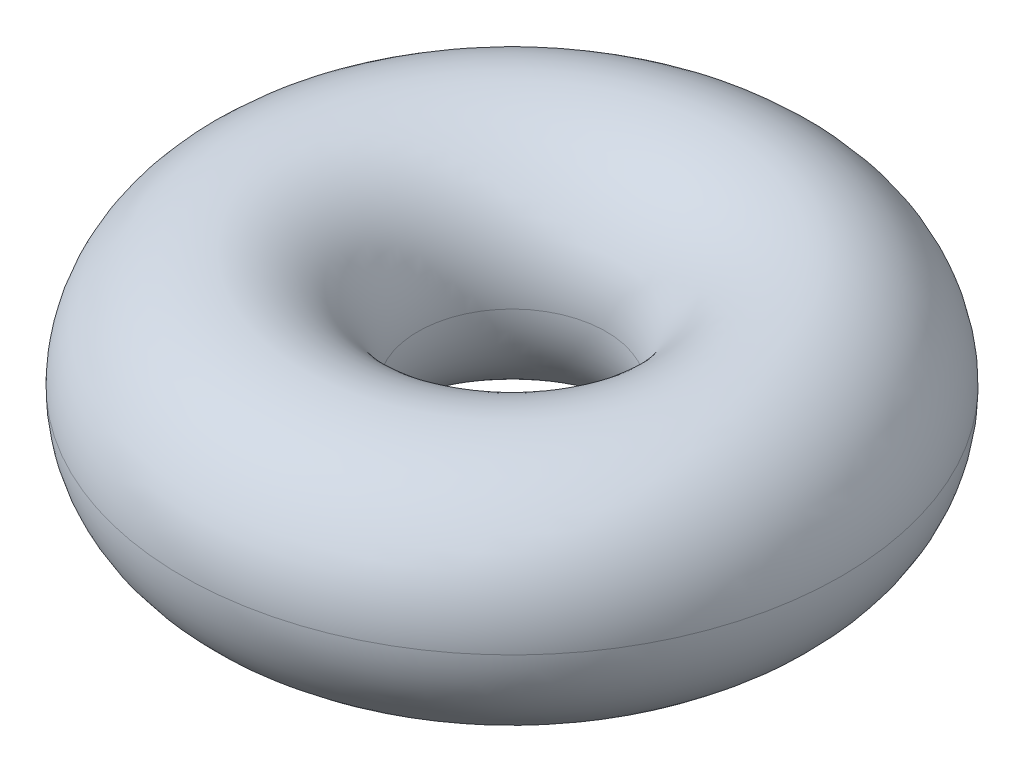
ISO-10303-21;
HEADER;
FILE_DESCRIPTION(('STEP AP214'),'2;1');
FILE_NAME('part.step','',(''),(''),'','','');
FILE_SCHEMA(('AUTOMOTIVE_DESIGN { 1 0 10303 214 1 1 1 1 }'));
ENDSEC;
DATA;
#1=APPLICATION_CONTEXT('core data for automotive mechanical design processes');
#2=APPLICATION_PROTOCOL_DEFINITION('international standard','automotive_design',2000,#1);
#3=PRODUCT_CONTEXT('',#1,'mechanical');
#4=PRODUCT('Part','Part','',(#3));
#5=PRODUCT_RELATED_PRODUCT_CATEGORY('part','',(#4));
#6=PRODUCT_DEFINITION_FORMATION('','',#4);
#7=PRODUCT_DEFINITION_CONTEXT('part definition',#1,'design');
#8=PRODUCT_DEFINITION('design','',#6,#7);
#9=PRODUCT_DEFINITION_SHAPE('','',#8);
#10=(LENGTH_UNIT() NAMED_UNIT(*) SI_UNIT(.MILLI.,.METRE.));
#11=(NAMED_UNIT(*) PLANE_ANGLE_UNIT() SI_UNIT($,.RADIAN.));
#12=(NAMED_UNIT(*) SI_UNIT($,.STERADIAN.) SOLID_ANGLE_UNIT());
#13=UNCERTAINTY_MEASURE_WITH_UNIT(LENGTH_MEASURE(1.E-05),#10,'distance_accuracy_value','');
#14=(GEOMETRIC_REPRESENTATION_CONTEXT(3) GLOBAL_UNCERTAINTY_ASSIGNED_CONTEXT((#13)) GLOBAL_UNIT_ASSIGNED_CONTEXT((#10,
#11,#12)) REPRESENTATION_CONTEXT('',''));
#15=CARTESIAN_POINT('',(0.,0.,0.));
#16=DIRECTION('',(0.,0.,1.));
#17=DIRECTION('',(1.,0.,0.));
#18=AXIS2_PLACEMENT_3D('',#15,#16,#17);
#19=CARTESIAN_POINT('',(0.,0.,0.));
#20=DIRECTION('',(0.,-1.,0.));
#21=DIRECTION('',(0.,0.,-1.));
#22=AXIS2_PLACEMENT_3D('',#19,#20,#21);
#23=TOROIDAL_SURFACE('',#22,22.5,12.5);
#24=CARTESIAN_POINT('',(0.,0.,0.));
#25=DIRECTION('',(0.,-1.,0.));
#26=DIRECTION('',(1.,0.,0.));
#27=AXIS2_PLACEMENT_3D('',#24,#25,#26);
#28=CIRCLE('',#27,10.);
#29=CARTESIAN_POINT('',(10.,0.,0.));
#30=VERTEX_POINT('',#29);
#31=EDGE_CURVE('E53',#30,#30,#28,.F.);
#32=ORIENTED_EDGE('',*,*,#31,.T.);
#33=EDGE_LOOP('',(#32));
#34=FACE_BOUND('',#33,.T.);
#35=CARTESIAN_POINT('',(0.,0.,0.));
#36=DIRECTION('',(0.,1.,0.));
#37=DIRECTION('',(-1.,0.,0.));
#38=AXIS2_PLACEMENT_3D('',#35,#36,#37);
#39=CIRCLE('',#38,35.);
#40=CARTESIAN_POINT('',(35.,0.,0.));
#41=VERTEX_POINT('',#40);
#42=CARTESIAN_POINT('',(-35.,0.,0.));
#43=VERTEX_POINT('',#42);
#44=EDGE_CURVE('E39',#41,#43,#39,.F.);
#45=ORIENTED_EDGE('',*,*,#44,.T.);
#46=EDGE_CURVE('E11',#43,#41,#39,.F.);
#47=ORIENTED_EDGE('',*,*,#46,.T.);
#48=EDGE_LOOP('',(#45,#47));
#49=FACE_BOUND('',#48,.T.);
#50=ADVANCED_FACE('F36',(#34,#49),#23,.T.);
#51=ORIENTED_EDGE('',*,*,#46,.F.);
#52=ORIENTED_EDGE('',*,*,#44,.F.);
#53=EDGE_LOOP('',(#51,#52));
#54=FACE_BOUND('',#53,.T.);
#55=ORIENTED_EDGE('',*,*,#31,.F.);
#56=EDGE_LOOP('',(#55));
#57=FACE_BOUND('',#56,.T.);
#58=ADVANCED_FACE('F38',(#54,#57),#23,.T.);
#59=CLOSED_SHELL('',(#50,#58));
#60=MANIFOLD_SOLID_BREP('B2',#59);
#61=ADVANCED_BREP_SHAPE_REPRESENTATION('',(#18,#60),#14);
#62=SHAPE_DEFINITION_REPRESENTATION(#9,#61);
ENDSEC;
END-ISO-10303-21;
